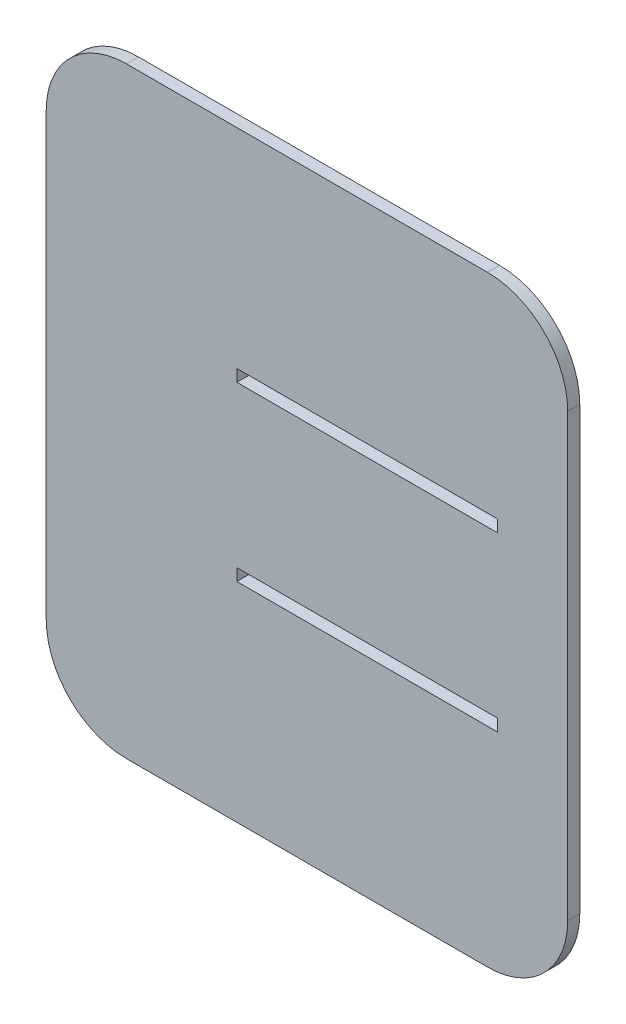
from build123d import *

# Parameters (mm, degrees)
ESQUISSE1_W        = 65
ESQUISSE1_H        = 3
BOSS_EXTRU_2_DEPTH = 3


with BuildPart() as part:
    # Esquisse1 → Boss.-Extru.2 (new body)
    with BuildSketch(Plane.XY):
        with BuildLine():
            Line((-5.640892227, 88.910505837), (84.359107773, 88.910505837))
            ThreePointArc((84.359107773, 88.910505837), (98.501243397, 83.05264146), (104.359107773, 68.910505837))
            Line((104.359107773, 68.910505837), (104.359107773, -41.089494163))
            ThreePointArc((104.359107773, -41.089494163), (98.501243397, -55.231629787), (84.359107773, -61.089494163))
            Line((84.359107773, -61.089494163), (-5.640892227, -61.089494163))
            ThreePointArc((-5.640892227, -61.089494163), (-19.783027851, -55.231629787), (-25.640892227, -41.089494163))
            Line((-25.640892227, -41.089494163), (-25.640892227, 68.910505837))
            ThreePointArc((-25.640892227, 68.910505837), (-19.783027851, 83.05264146), (-5.640892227, 88.910505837))
        make_face()
        with Locations((54.359107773, 35.410505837)):
            Rectangle(ESQUISSE1_W, ESQUISSE1_H, mode=Mode.SUBTRACT)
        with Locations((54.359107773, -7.589494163)):
            Rectangle(ESQUISSE1_W, ESQUISSE1_H, mode=Mode.SUBTRACT)
    extrude(amount=BOSS_EXTRU_2_DEPTH)


solid = part.part
